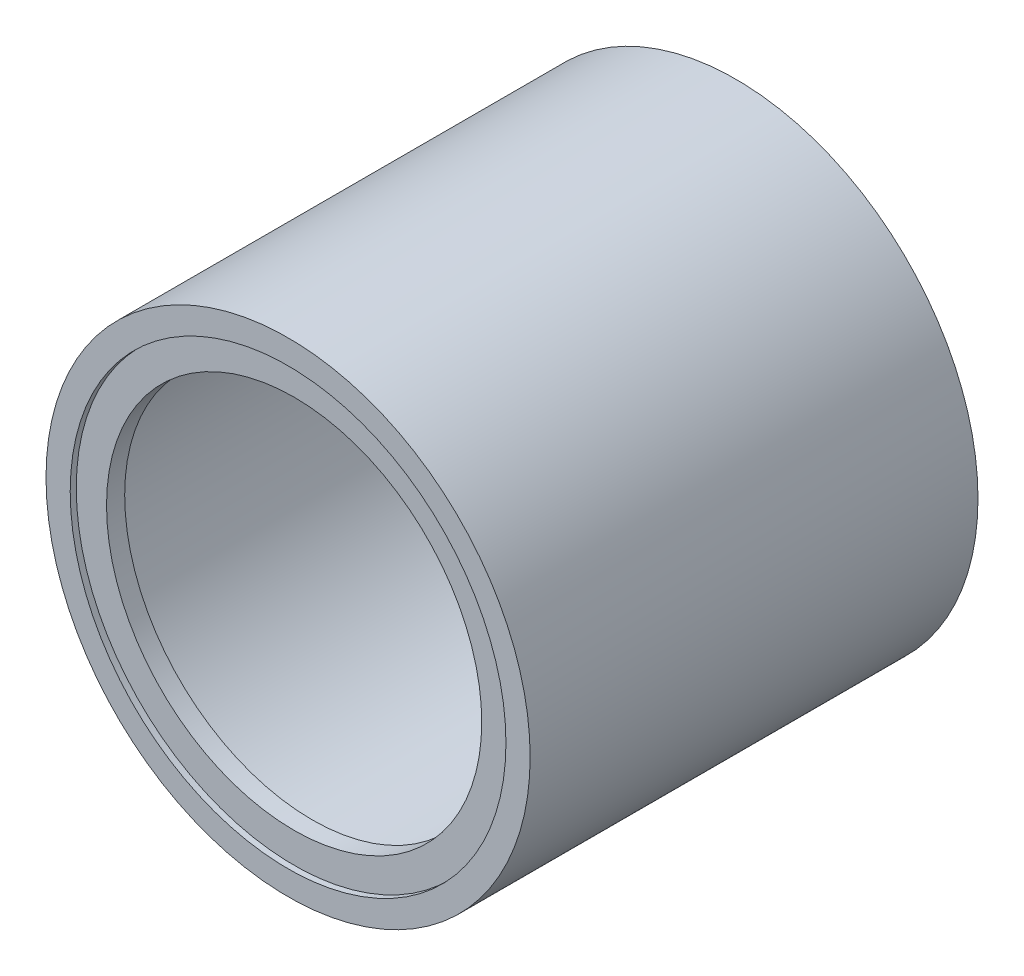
ISO-10303-21;
HEADER;
FILE_DESCRIPTION(('STEP AP214'),'2;1');
FILE_NAME('part.step','',(''),(''),'','','');
FILE_SCHEMA(('AUTOMOTIVE_DESIGN { 1 0 10303 214 1 1 1 1 }'));
ENDSEC;
DATA;
#1=APPLICATION_CONTEXT('core data for automotive mechanical design processes');
#2=APPLICATION_PROTOCOL_DEFINITION('international standard','automotive_design',2000,#1);
#3=PRODUCT_CONTEXT('',#1,'mechanical');
#4=PRODUCT('Part','Part','',(#3));
#5=PRODUCT_RELATED_PRODUCT_CATEGORY('part','',(#4));
#6=PRODUCT_DEFINITION_FORMATION('','',#4);
#7=PRODUCT_DEFINITION_CONTEXT('part definition',#1,'design');
#8=PRODUCT_DEFINITION('design','',#6,#7);
#9=PRODUCT_DEFINITION_SHAPE('','',#8);
#10=(LENGTH_UNIT() NAMED_UNIT(*) SI_UNIT(.MILLI.,.METRE.));
#11=(NAMED_UNIT(*) PLANE_ANGLE_UNIT() SI_UNIT($,.RADIAN.));
#12=(NAMED_UNIT(*) SI_UNIT($,.STERADIAN.) SOLID_ANGLE_UNIT());
#13=UNCERTAINTY_MEASURE_WITH_UNIT(LENGTH_MEASURE(1.E-05),#10,'distance_accuracy_value','');
#14=(GEOMETRIC_REPRESENTATION_CONTEXT(3) GLOBAL_UNCERTAINTY_ASSIGNED_CONTEXT((#13)) GLOBAL_UNIT_ASSIGNED_CONTEXT((#10,
#11,#12)) REPRESENTATION_CONTEXT('',''));
#15=CARTESIAN_POINT('',(0.,0.,0.));
#16=DIRECTION('',(0.,0.,1.));
#17=DIRECTION('',(1.,0.,0.));
#18=AXIS2_PLACEMENT_3D('',#15,#16,#17);
#19=CARTESIAN_POINT('',(0.,20.,37.));
#20=DIRECTION('',(0.,0.,-1.));
#21=DIRECTION('',(-1.,0.,0.));
#22=AXIS2_PLACEMENT_3D('',#19,#20,#21);
#23=PLANE('',#22);
#24=CARTESIAN_POINT('',(0.,0.,37.));
#25=DIRECTION('',(0.,0.,1.));
#26=DIRECTION('',(1.,0.,0.));
#27=AXIS2_PLACEMENT_3D('',#24,#25,#26);
#28=CIRCLE('',#27,18.);
#29=CARTESIAN_POINT('',(18.,0.,37.));
#30=VERTEX_POINT('',#29);
#31=EDGE_CURVE('E8',#30,#30,#28,.T.);
#32=ORIENTED_EDGE('',*,*,#31,.F.);
#33=EDGE_LOOP('',(#32));
#34=FACE_BOUND('',#33,.T.);
#35=CARTESIAN_POINT('',(0.,0.,37.));
#36=DIRECTION('',(0.,0.,1.));
#37=DIRECTION('',(1.,0.,0.));
#38=AXIS2_PLACEMENT_3D('',#35,#36,#37);
#39=CIRCLE('',#38,20.);
#40=CARTESIAN_POINT('',(20.,0.,37.));
#41=VERTEX_POINT('',#40);
#42=EDGE_CURVE('E40',#41,#41,#39,.T.);
#43=ORIENTED_EDGE('',*,*,#42,.T.);
#44=EDGE_LOOP('',(#43));
#45=FACE_BOUND('',#44,.T.);
#46=ADVANCED_FACE('F12',(#34,#45),#23,.F.);
#47=CARTESIAN_POINT('',(0.,0.,37.));
#48=DIRECTION('',(0.,0.,1.));
#49=DIRECTION('',(1.,0.,0.));
#50=AXIS2_PLACEMENT_3D('',#47,#48,#49);
#51=CYLINDRICAL_SURFACE('',#50,18.);
#52=CARTESIAN_POINT('',(0.,0.,36.5));
#53=DIRECTION('',(0.,0.,1.));
#54=DIRECTION('',(1.,0.,0.));
#55=AXIS2_PLACEMENT_3D('',#52,#53,#54);
#56=CIRCLE('',#55,18.);
#57=CARTESIAN_POINT('',(18.,0.,36.5));
#58=VERTEX_POINT('',#57);
#59=EDGE_CURVE('E18',#58,#58,#56,.T.);
#60=ORIENTED_EDGE('',*,*,#59,.F.);
#61=EDGE_LOOP('',(#60));
#62=FACE_BOUND('',#61,.T.);
#63=ORIENTED_EDGE('',*,*,#31,.T.);
#64=EDGE_LOOP('',(#63));
#65=FACE_BOUND('',#64,.T.);
#66=ADVANCED_FACE('F77',(#62,#65),#51,.F.);
#67=CARTESIAN_POINT('',(0.,18.,36.5));
#68=DIRECTION('',(0.,0.,-1.));
#69=DIRECTION('',(-1.,0.,0.));
#70=AXIS2_PLACEMENT_3D('',#67,#68,#69);
#71=PLANE('',#70);
#72=CARTESIAN_POINT('',(0.,0.,36.5));
#73=DIRECTION('',(0.,0.,1.));
#74=DIRECTION('',(1.,0.,0.));
#75=AXIS2_PLACEMENT_3D('',#72,#73,#74);
#76=CIRCLE('',#75,15.5);
#77=CARTESIAN_POINT('',(15.5,0.,36.5));
#78=VERTEX_POINT('',#77);
#79=EDGE_CURVE('E22',#78,#78,#76,.T.);
#80=ORIENTED_EDGE('',*,*,#79,.F.);
#81=EDGE_LOOP('',(#80));
#82=FACE_BOUND('',#81,.T.);
#83=ORIENTED_EDGE('',*,*,#59,.T.);
#84=EDGE_LOOP('',(#83));
#85=FACE_BOUND('',#84,.T.);
#86=ADVANCED_FACE('F72',(#82,#85),#71,.F.);
#87=CARTESIAN_POINT('',(0.,0.,37.));
#88=DIRECTION('',(0.,0.,1.));
#89=DIRECTION('',(1.,0.,0.));
#90=AXIS2_PLACEMENT_3D('',#87,#88,#89);
#91=CYLINDRICAL_SURFACE('',#90,15.5);
#92=CARTESIAN_POINT('',(0.,0.,35.));
#93=DIRECTION('',(0.,0.,1.));
#94=DIRECTION('',(1.,0.,0.));
#95=AXIS2_PLACEMENT_3D('',#92,#93,#94);
#96=CIRCLE('',#95,15.5);
#97=CARTESIAN_POINT('',(15.5,0.,35.));
#98=VERTEX_POINT('',#97);
#99=EDGE_CURVE('E26',#98,#98,#96,.T.);
#100=ORIENTED_EDGE('',*,*,#99,.F.);
#101=EDGE_LOOP('',(#100));
#102=FACE_BOUND('',#101,.T.);
#103=ORIENTED_EDGE('',*,*,#79,.T.);
#104=EDGE_LOOP('',(#103));
#105=FACE_BOUND('',#104,.T.);
#106=ADVANCED_FACE('F66',(#102,#105),#91,.F.);
#107=CARTESIAN_POINT('',(0.,15.5,35.));
#108=DIRECTION('',(0.,0.,1.));
#109=DIRECTION('',(1.,0.,0.));
#110=AXIS2_PLACEMENT_3D('',#107,#108,#109);
#111=PLANE('',#110);
#112=CARTESIAN_POINT('',(0.,0.,35.));
#113=DIRECTION('',(0.,0.,1.));
#114=DIRECTION('',(1.,0.,0.));
#115=AXIS2_PLACEMENT_3D('',#112,#113,#114);
#116=CIRCLE('',#115,18.5);
#117=CARTESIAN_POINT('',(18.5,0.,35.));
#118=VERTEX_POINT('',#117);
#119=EDGE_CURVE('E31',#118,#118,#116,.T.);
#120=ORIENTED_EDGE('',*,*,#119,.F.);
#121=EDGE_LOOP('',(#120));
#122=FACE_BOUND('',#121,.T.);
#123=ORIENTED_EDGE('',*,*,#99,.T.);
#124=EDGE_LOOP('',(#123));
#125=FACE_BOUND('',#124,.T.);
#126=ADVANCED_FACE('F60',(#122,#125),#111,.F.);
#127=CARTESIAN_POINT('',(0.,0.,37.));
#128=DIRECTION('',(0.,0.,1.));
#129=DIRECTION('',(1.,0.,0.));
#130=AXIS2_PLACEMENT_3D('',#127,#128,#129);
#131=CYLINDRICAL_SURFACE('',#130,18.5);
#132=CARTESIAN_POINT('',(0.,0.,0.));
#133=DIRECTION('',(0.,0.,1.));
#134=DIRECTION('',(1.,0.,0.));
#135=AXIS2_PLACEMENT_3D('',#132,#133,#134);
#136=CIRCLE('',#135,18.5);
#137=CARTESIAN_POINT('',(18.5,0.,0.));
#138=VERTEX_POINT('',#137);
#139=EDGE_CURVE('E34',#138,#138,#136,.T.);
#140=ORIENTED_EDGE('',*,*,#139,.F.);
#141=EDGE_LOOP('',(#140));
#142=FACE_BOUND('',#141,.T.);
#143=ORIENTED_EDGE('',*,*,#119,.T.);
#144=EDGE_LOOP('',(#143));
#145=FACE_BOUND('',#144,.T.);
#146=ADVANCED_FACE('F54',(#142,#145),#131,.F.);
#147=CARTESIAN_POINT('',(0.,20.,0.));
#148=DIRECTION('',(0.,0.,1.));
#149=DIRECTION('',(1.,0.,0.));
#150=AXIS2_PLACEMENT_3D('',#147,#148,#149);
#151=PLANE('',#150);
#152=CARTESIAN_POINT('',(0.,0.,0.));
#153=DIRECTION('',(0.,0.,1.));
#154=DIRECTION('',(1.,0.,0.));
#155=AXIS2_PLACEMENT_3D('',#152,#153,#154);
#156=CIRCLE('',#155,20.);
#157=CARTESIAN_POINT('',(20.,0.,0.));
#158=VERTEX_POINT('',#157);
#159=EDGE_CURVE('E37',#158,#158,#156,.T.);
#160=ORIENTED_EDGE('',*,*,#159,.F.);
#161=EDGE_LOOP('',(#160));
#162=FACE_BOUND('',#161,.T.);
#163=ORIENTED_EDGE('',*,*,#139,.T.);
#164=EDGE_LOOP('',(#163));
#165=FACE_BOUND('',#164,.T.);
#166=ADVANCED_FACE('F48',(#162,#165),#151,.F.);
#167=CARTESIAN_POINT('',(0.,0.,37.));
#168=DIRECTION('',(0.,0.,1.));
#169=DIRECTION('',(1.,0.,0.));
#170=AXIS2_PLACEMENT_3D('',#167,#168,#169);
#171=CYLINDRICAL_SURFACE('',#170,20.);
#172=ORIENTED_EDGE('',*,*,#42,.F.);
#173=EDGE_LOOP('',(#172));
#174=FACE_BOUND('',#173,.T.);
#175=ORIENTED_EDGE('',*,*,#159,.T.);
#176=EDGE_LOOP('',(#175));
#177=FACE_BOUND('',#176,.T.);
#178=ADVANCED_FACE('F45',(#174,#177),#171,.T.);
#179=CLOSED_SHELL('',(#46,#66,#86,#106,#126,#146,#166,#178));
#180=MANIFOLD_SOLID_BREP('B1',#179);
#181=ADVANCED_BREP_SHAPE_REPRESENTATION('',(#18,#180),#14);
#182=SHAPE_DEFINITION_REPRESENTATION(#9,#181);
ENDSEC;
END-ISO-10303-21;
